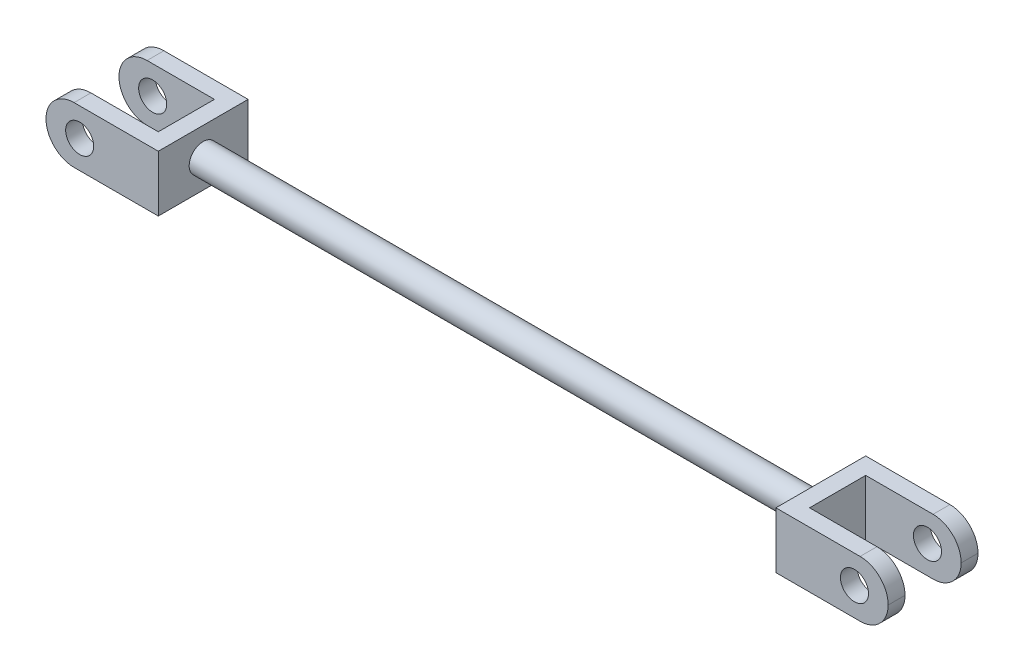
ISO-10303-21;
HEADER;
FILE_DESCRIPTION(('STEP AP214'),'2;1');
FILE_NAME('part.step','',(''),(''),'','','');
FILE_SCHEMA(('AUTOMOTIVE_DESIGN { 1 0 10303 214 1 1 1 1 }'));
ENDSEC;
DATA;
#1=APPLICATION_CONTEXT('core data for automotive mechanical design processes');
#2=APPLICATION_PROTOCOL_DEFINITION('international standard','automotive_design',2000,#1);
#3=PRODUCT_CONTEXT('',#1,'mechanical');
#4=PRODUCT('Part','Part','',(#3));
#5=PRODUCT_RELATED_PRODUCT_CATEGORY('part','',(#4));
#6=PRODUCT_DEFINITION_FORMATION('','',#4);
#7=PRODUCT_DEFINITION_CONTEXT('part definition',#1,'design');
#8=PRODUCT_DEFINITION('design','',#6,#7);
#9=PRODUCT_DEFINITION_SHAPE('','',#8);
#10=(LENGTH_UNIT() NAMED_UNIT(*) SI_UNIT(.MILLI.,.METRE.));
#11=(NAMED_UNIT(*) PLANE_ANGLE_UNIT() SI_UNIT($,.RADIAN.));
#12=(NAMED_UNIT(*) SI_UNIT($,.STERADIAN.) SOLID_ANGLE_UNIT());
#13=UNCERTAINTY_MEASURE_WITH_UNIT(LENGTH_MEASURE(1.E-05),#10,'distance_accuracy_value','');
#14=(GEOMETRIC_REPRESENTATION_CONTEXT(3) GLOBAL_UNCERTAINTY_ASSIGNED_CONTEXT((#13)) GLOBAL_UNIT_ASSIGNED_CONTEXT((#10,
#11,#12)) REPRESENTATION_CONTEXT('',''));
#15=CARTESIAN_POINT('',(0.,0.,0.));
#16=DIRECTION('',(0.,0.,1.));
#17=DIRECTION('',(1.,0.,0.));
#18=AXIS2_PLACEMENT_3D('',#15,#16,#17);
#19=CARTESIAN_POINT('',(0.,4.99999999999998,5.));
#20=DIRECTION('',(0.,0.,-0.999999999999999));
#21=DIRECTION('',(-1.,0.,0.));
#22=AXIS2_PLACEMENT_3D('',#19,#20,#21);
#23=PLANE('',#22);
#24=CARTESIAN_POINT('',(6.00000000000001,0.,5.));
#25=DIRECTION('',(0.,0.,-0.999999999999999));
#26=DIRECTION('',(-1.,0.,0.));
#27=AXIS2_PLACEMENT_3D('',#24,#25,#26);
#28=CIRCLE('',#27,2.5);
#29=CARTESIAN_POINT('',(8.50000000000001,0.,5.));
#30=VERTEX_POINT('',#29);
#31=EDGE_CURVE('E294',#30,#30,#28,.T.);
#32=ORIENTED_EDGE('',*,*,#31,.F.);
#33=EDGE_LOOP('',(#32));
#34=FACE_BOUND('',#33,.T.);
#35=DIRECTION('',(1.,0.,0.));
#36=VECTOR('',#35,1.);
#37=CARTESIAN_POINT('',(0.,-5.,5.));
#38=LINE('',#37,#36);
#39=CARTESIAN_POINT('',(5.,-5.,5.));
#40=VERTEX_POINT('',#39);
#41=CARTESIAN_POINT('',(17.,-5.,5.));
#42=VERTEX_POINT('',#41);
#43=EDGE_CURVE('E297',#40,#42,#38,.T.);
#44=ORIENTED_EDGE('',*,*,#43,.F.);
#45=CARTESIAN_POINT('',(5.,0.,5.));
#46=DIRECTION('',(0.,0.,-0.999999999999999));
#47=DIRECTION('',(-1.,0.,0.));
#48=AXIS2_PLACEMENT_3D('',#45,#46,#47);
#49=CIRCLE('',#48,5.);
#50=CARTESIAN_POINT('',(0.,0.,5.));
#51=VERTEX_POINT('',#50);
#52=EDGE_CURVE('E71',#40,#51,#49,.T.);
#53=ORIENTED_EDGE('',*,*,#52,.T.);
#54=CARTESIAN_POINT('',(5.,0.,5.));
#55=DIRECTION('',(0.,0.,-0.999999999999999));
#56=DIRECTION('',(-1.,0.,0.));
#57=AXIS2_PLACEMENT_3D('',#54,#55,#56);
#58=CIRCLE('',#57,5.);
#59=CARTESIAN_POINT('',(5.,5.,5.));
#60=VERTEX_POINT('',#59);
#61=EDGE_CURVE('E357',#51,#60,#58,.T.);
#62=ORIENTED_EDGE('',*,*,#61,.T.);
#63=DIRECTION('',(1.,0.,0.));
#64=VECTOR('',#63,1.);
#65=CARTESIAN_POINT('',(0.,4.99999999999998,5.));
#66=LINE('',#65,#64);
#67=CARTESIAN_POINT('',(17.,5.,5.));
#68=VERTEX_POINT('',#67);
#69=EDGE_CURVE('E298',#60,#68,#66,.T.);
#70=ORIENTED_EDGE('',*,*,#69,.T.);
#71=DIRECTION('',(0.,-1.,0.));
#72=VECTOR('',#71,1.);
#73=CARTESIAN_POINT('',(17.,5.,5.));
#74=LINE('',#73,#72);
#75=EDGE_CURVE('E313',#68,#42,#74,.T.);
#76=ORIENTED_EDGE('',*,*,#75,.T.);
#77=EDGE_LOOP('',(#44,#53,#62,#70,#76));
#78=FACE_BOUND('',#77,.T.);
#79=ADVANCED_FACE('F48',(#34,#78),#23,.T.);
#80=CARTESIAN_POINT('',(0.,4.99999999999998,7.99999999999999));
#81=DIRECTION('',(0.,0.,0.999999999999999));
#82=DIRECTION('',(1.,0.,0.));
#83=AXIS2_PLACEMENT_3D('',#80,#81,#82);
#84=PLANE('',#83);
#85=CARTESIAN_POINT('',(6.00000000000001,0.,7.99999999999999));
#86=DIRECTION('',(0.,0.,0.999999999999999));
#87=DIRECTION('',(1.,0.,0.));
#88=AXIS2_PLACEMENT_3D('',#85,#86,#87);
#89=CIRCLE('',#88,2.5);
#90=CARTESIAN_POINT('',(8.50000000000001,0.,7.99999999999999));
#91=VERTEX_POINT('',#90);
#92=EDGE_CURVE('E291',#91,#91,#89,.T.);
#93=ORIENTED_EDGE('',*,*,#92,.F.);
#94=EDGE_LOOP('',(#93));
#95=FACE_BOUND('',#94,.T.);
#96=CARTESIAN_POINT('',(5.,0.,7.99999999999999));
#97=DIRECTION('',(0.,0.,0.999999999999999));
#98=DIRECTION('',(1.,0.,0.));
#99=AXIS2_PLACEMENT_3D('',#96,#97,#98);
#100=CIRCLE('',#99,5.);
#101=CARTESIAN_POINT('',(5.,5.,7.99999999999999));
#102=VERTEX_POINT('',#101);
#103=CARTESIAN_POINT('',(0.,0.,7.99999999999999));
#104=VERTEX_POINT('',#103);
#105=EDGE_CURVE('E63',#102,#104,#100,.T.);
#106=ORIENTED_EDGE('',*,*,#105,.T.);
#107=CARTESIAN_POINT('',(5.,0.,7.99999999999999));
#108=DIRECTION('',(0.,0.,0.999999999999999));
#109=DIRECTION('',(1.,0.,0.));
#110=AXIS2_PLACEMENT_3D('',#107,#108,#109);
#111=CIRCLE('',#110,5.);
#112=CARTESIAN_POINT('',(5.,-5.,7.99999999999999));
#113=VERTEX_POINT('',#112);
#114=EDGE_CURVE('E56',#104,#113,#111,.T.);
#115=ORIENTED_EDGE('',*,*,#114,.T.);
#116=DIRECTION('',(-1.,0.,0.));
#117=VECTOR('',#116,1.);
#118=CARTESIAN_POINT('',(0.,-5.,7.99999999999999));
#119=LINE('',#118,#117);
#120=CARTESIAN_POINT('',(20.,-5.,7.99999999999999));
#121=VERTEX_POINT('',#120);
#122=EDGE_CURVE('E315',#121,#113,#119,.T.);
#123=ORIENTED_EDGE('',*,*,#122,.F.);
#124=DIRECTION('',(0.,-1.,0.));
#125=VECTOR('',#124,1.);
#126=CARTESIAN_POINT('',(20.,4.99999999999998,7.99999999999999));
#127=LINE('',#126,#125);
#128=CARTESIAN_POINT('',(20.,4.99999999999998,7.99999999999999));
#129=VERTEX_POINT('',#128);
#130=EDGE_CURVE('E335',#129,#121,#127,.T.);
#131=ORIENTED_EDGE('',*,*,#130,.F.);
#132=DIRECTION('',(-1.,0.,0.));
#133=VECTOR('',#132,1.);
#134=CARTESIAN_POINT('',(0.,4.99999999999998,7.99999999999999));
#135=LINE('',#134,#133);
#136=EDGE_CURVE('E300',#129,#102,#135,.T.);
#137=ORIENTED_EDGE('',*,*,#136,.T.);
#138=EDGE_LOOP('',(#106,#115,#123,#131,#137));
#139=FACE_BOUND('',#138,.T.);
#140=ADVANCED_FACE('F387',(#95,#139),#84,.T.);
#141=CARTESIAN_POINT('',(20.,4.99999999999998,0.));
#142=DIRECTION('',(-1.,0.,0.));
#143=DIRECTION('',(0.,0.,0.999999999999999));
#144=AXIS2_PLACEMENT_3D('',#141,#142,#143);
#145=PLANE('',#144);
#146=CARTESIAN_POINT('',(20.,0.,0.));
#147=DIRECTION('',(-1.,0.,0.));
#148=DIRECTION('',(0.,0.,0.999999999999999));
#149=AXIS2_PLACEMENT_3D('',#146,#147,#148);
#150=CIRCLE('',#149,2.5);
#151=CARTESIAN_POINT('',(20.,0.,2.5));
#152=VERTEX_POINT('',#151);
#153=EDGE_CURVE('E13',#152,#152,#150,.F.);
#154=ORIENTED_EDGE('',*,*,#153,.F.);
#155=EDGE_LOOP('',(#154));
#156=FACE_BOUND('',#155,.T.);
#157=DIRECTION('',(0.,0.,-0.999999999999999));
#158=VECTOR('',#157,1.);
#159=CARTESIAN_POINT('',(20.,-5.,0.));
#160=LINE('',#159,#158);
#161=CARTESIAN_POINT('',(20.,-5.,-7.99999999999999));
#162=VERTEX_POINT('',#161);
#163=EDGE_CURVE('E318',#121,#162,#160,.T.);
#164=ORIENTED_EDGE('',*,*,#163,.T.);
#165=DIRECTION('',(0.,-1.,0.));
#166=VECTOR('',#165,1.);
#167=CARTESIAN_POINT('',(20.,4.99999999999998,-7.99999999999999));
#168=LINE('',#167,#166);
#169=CARTESIAN_POINT('',(20.,4.99999999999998,-7.99999999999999));
#170=VERTEX_POINT('',#169);
#171=EDGE_CURVE('E332',#170,#162,#168,.T.);
#172=ORIENTED_EDGE('',*,*,#171,.F.);
#173=DIRECTION('',(0.,0.,-0.999999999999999));
#174=VECTOR('',#173,1.);
#175=CARTESIAN_POINT('',(20.,4.99999999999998,0.));
#176=LINE('',#175,#174);
#177=EDGE_CURVE('E303',#129,#170,#176,.T.);
#178=ORIENTED_EDGE('',*,*,#177,.F.);
#179=ORIENTED_EDGE('',*,*,#130,.T.);
#180=EDGE_LOOP('',(#164,#172,#178,#179));
#181=FACE_BOUND('',#180,.T.);
#182=ADVANCED_FACE('F391',(#156,#181),#145,.F.);
#183=CARTESIAN_POINT('',(0.,4.99999999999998,-7.99999999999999));
#184=DIRECTION('',(0.,0.,0.999999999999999));
#185=DIRECTION('',(1.,0.,0.));
#186=AXIS2_PLACEMENT_3D('',#183,#184,#185);
#187=PLANE('',#186);
#188=CARTESIAN_POINT('',(6.00000000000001,0.,-7.99999999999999));
#189=DIRECTION('',(0.,0.,0.999999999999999));
#190=DIRECTION('',(1.,0.,0.));
#191=AXIS2_PLACEMENT_3D('',#188,#189,#190);
#192=CIRCLE('',#191,2.5);
#193=CARTESIAN_POINT('',(8.50000000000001,0.,-7.99999999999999));
#194=VERTEX_POINT('',#193);
#195=EDGE_CURVE('E286',#194,#194,#192,.T.);
#196=ORIENTED_EDGE('',*,*,#195,.T.);
#197=EDGE_LOOP('',(#196));
#198=FACE_BOUND('',#197,.T.);
#199=CARTESIAN_POINT('',(5.,0.,-7.99999999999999));
#200=DIRECTION('',(0.,0.,0.999999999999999));
#201=DIRECTION('',(1.,0.,0.));
#202=AXIS2_PLACEMENT_3D('',#199,#200,#201);
#203=CIRCLE('',#202,5.);
#204=CARTESIAN_POINT('',(5.,-5.,-7.99999999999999));
#205=VERTEX_POINT('',#204);
#206=CARTESIAN_POINT('',(0.,0.,-7.99999999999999));
#207=VERTEX_POINT('',#206);
#208=EDGE_CURVE('E348',#205,#207,#203,.F.);
#209=ORIENTED_EDGE('',*,*,#208,.T.);
#210=CARTESIAN_POINT('',(5.,0.,-7.99999999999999));
#211=DIRECTION('',(0.,0.,0.999999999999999));
#212=DIRECTION('',(1.,0.,0.));
#213=AXIS2_PLACEMENT_3D('',#210,#211,#212);
#214=CIRCLE('',#213,5.);
#215=CARTESIAN_POINT('',(5.,5.,-7.99999999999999));
#216=VERTEX_POINT('',#215);
#217=EDGE_CURVE('E350',#207,#216,#214,.F.);
#218=ORIENTED_EDGE('',*,*,#217,.T.);
#219=DIRECTION('',(-1.,0.,0.));
#220=VECTOR('',#219,1.);
#221=CARTESIAN_POINT('',(0.,4.99999999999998,-7.99999999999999));
#222=LINE('',#221,#220);
#223=EDGE_CURVE('E305',#170,#216,#222,.T.);
#224=ORIENTED_EDGE('',*,*,#223,.F.);
#225=ORIENTED_EDGE('',*,*,#171,.T.);
#226=DIRECTION('',(-1.,0.,0.));
#227=VECTOR('',#226,1.);
#228=CARTESIAN_POINT('',(0.,-5.,-7.99999999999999));
#229=LINE('',#228,#227);
#230=EDGE_CURVE('E320',#162,#205,#229,.T.);
#231=ORIENTED_EDGE('',*,*,#230,.T.);
#232=EDGE_LOOP('',(#209,#218,#224,#225,#231));
#233=FACE_BOUND('',#232,.T.);
#234=ADVANCED_FACE('F406',(#198,#233),#187,.F.);
#235=CARTESIAN_POINT('',(0.,4.99999999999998,-5.));
#236=DIRECTION('',(0.,0.,-0.999999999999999));
#237=DIRECTION('',(-1.,0.,0.));
#238=AXIS2_PLACEMENT_3D('',#235,#236,#237);
#239=PLANE('',#238);
#240=CARTESIAN_POINT('',(6.00000000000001,0.,-5.));
#241=DIRECTION('',(0.,0.,-0.999999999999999));
#242=DIRECTION('',(-1.,0.,0.));
#243=AXIS2_PLACEMENT_3D('',#240,#241,#242);
#244=CIRCLE('',#243,2.5);
#245=CARTESIAN_POINT('',(8.50000000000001,0.,-4.99999999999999));
#246=VERTEX_POINT('',#245);
#247=EDGE_CURVE('E289',#246,#246,#244,.T.);
#248=ORIENTED_EDGE('',*,*,#247,.T.);
#249=EDGE_LOOP('',(#248));
#250=FACE_BOUND('',#249,.T.);
#251=DIRECTION('',(1.,0.,0.));
#252=VECTOR('',#251,1.);
#253=CARTESIAN_POINT('',(0.,4.99999999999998,-5.));
#254=LINE('',#253,#252);
#255=CARTESIAN_POINT('',(5.,5.,-5.));
#256=VERTEX_POINT('',#255);
#257=CARTESIAN_POINT('',(17.,5.,-5.));
#258=VERTEX_POINT('',#257);
#259=EDGE_CURVE('E308',#256,#258,#254,.T.);
#260=ORIENTED_EDGE('',*,*,#259,.F.);
#261=CARTESIAN_POINT('',(5.,0.,-5.));
#262=DIRECTION('',(0.,0.,-0.999999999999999));
#263=DIRECTION('',(-1.,0.,0.));
#264=AXIS2_PLACEMENT_3D('',#261,#262,#263);
#265=CIRCLE('',#264,5.);
#266=CARTESIAN_POINT('',(0.,0.,-5.));
#267=VERTEX_POINT('',#266);
#268=EDGE_CURVE('E346',#256,#267,#265,.F.);
#269=ORIENTED_EDGE('',*,*,#268,.T.);
#270=CARTESIAN_POINT('',(5.,0.,-5.));
#271=DIRECTION('',(0.,0.,-0.999999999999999));
#272=DIRECTION('',(-1.,0.,0.));
#273=AXIS2_PLACEMENT_3D('',#270,#271,#272);
#274=CIRCLE('',#273,5.);
#275=CARTESIAN_POINT('',(5.,-5.,-5.));
#276=VERTEX_POINT('',#275);
#277=EDGE_CURVE('E344',#267,#276,#274,.F.);
#278=ORIENTED_EDGE('',*,*,#277,.T.);
#279=DIRECTION('',(1.,0.,0.));
#280=VECTOR('',#279,1.);
#281=CARTESIAN_POINT('',(0.,-5.,-5.));
#282=LINE('',#281,#280);
#283=CARTESIAN_POINT('',(17.,-5.,-5.));
#284=VERTEX_POINT('',#283);
#285=EDGE_CURVE('E323',#276,#284,#282,.T.);
#286=ORIENTED_EDGE('',*,*,#285,.T.);
#287=DIRECTION('',(0.,-1.,0.));
#288=VECTOR('',#287,1.);
#289=CARTESIAN_POINT('',(17.,5.,-5.));
#290=LINE('',#289,#288);
#291=EDGE_CURVE('E329',#258,#284,#290,.T.);
#292=ORIENTED_EDGE('',*,*,#291,.F.);
#293=EDGE_LOOP('',(#260,#269,#278,#286,#292));
#294=FACE_BOUND('',#293,.T.);
#295=ADVANCED_FACE('F401',(#250,#294),#239,.F.);
#296=CARTESIAN_POINT('',(17.,5.,0.));
#297=DIRECTION('',(1.,0.,0.));
#298=DIRECTION('',(0.,0.,-0.999999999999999));
#299=AXIS2_PLACEMENT_3D('',#296,#297,#298);
#300=PLANE('',#299);
#301=DIRECTION('',(0.,0.,0.999999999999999));
#302=VECTOR('',#301,1.);
#303=CARTESIAN_POINT('',(17.,-5.,0.));
#304=LINE('',#303,#302);
#305=EDGE_CURVE('E301',#284,#42,#304,.T.);
#306=ORIENTED_EDGE('',*,*,#305,.T.);
#307=ORIENTED_EDGE('',*,*,#75,.F.);
#308=DIRECTION('',(0.,0.,0.999999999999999));
#309=VECTOR('',#308,1.);
#310=CARTESIAN_POINT('',(17.,5.,0.));
#311=LINE('',#310,#309);
#312=EDGE_CURVE('E310',#258,#68,#311,.T.);
#313=ORIENTED_EDGE('',*,*,#312,.F.);
#314=ORIENTED_EDGE('',*,*,#291,.T.);
#315=EDGE_LOOP('',(#306,#307,#313,#314));
#316=FACE_BOUND('',#315,.T.);
#317=ADVANCED_FACE('F379',(#316),#300,.F.);
#318=CARTESIAN_POINT('',(0.,4.99999999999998,0.));
#319=DIRECTION('',(0.,1.,0.));
#320=DIRECTION('',(0.,0.,0.999999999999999));
#321=AXIS2_PLACEMENT_3D('',#318,#319,#320);
#322=PLANE('',#321);
#323=ORIENTED_EDGE('',*,*,#223,.T.);
#324=DIRECTION('',(0.,0.,0.999999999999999));
#325=VECTOR('',#324,1.);
#326=CARTESIAN_POINT('',(5.,5.,-5.));
#327=LINE('',#326,#325);
#328=EDGE_CURVE('E341',#216,#256,#327,.T.);
#329=ORIENTED_EDGE('',*,*,#328,.T.);
#330=ORIENTED_EDGE('',*,*,#259,.T.);
#331=ORIENTED_EDGE('',*,*,#312,.T.);
#332=ORIENTED_EDGE('',*,*,#69,.F.);
#333=DIRECTION('',(0.,0.,-0.999999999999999));
#334=VECTOR('',#333,1.);
#335=CARTESIAN_POINT('',(5.,5.,0.));
#336=LINE('',#335,#334);
#337=EDGE_CURVE('E337',#60,#102,#336,.F.);
#338=ORIENTED_EDGE('',*,*,#337,.T.);
#339=ORIENTED_EDGE('',*,*,#136,.F.);
#340=ORIENTED_EDGE('',*,*,#177,.T.);
#341=EDGE_LOOP('',(#323,#329,#330,#331,#332,#338,#339,#340));
#342=FACE_BOUND('',#341,.T.);
#343=ADVANCED_FACE('F372',(#342),#322,.T.);
#344=CARTESIAN_POINT('',(0.,-5.,0.));
#345=DIRECTION('',(0.,1.,0.));
#346=DIRECTION('',(0.,0.,0.999999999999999));
#347=AXIS2_PLACEMENT_3D('',#344,#345,#346);
#348=PLANE('',#347);
#349=ORIENTED_EDGE('',*,*,#285,.F.);
#350=DIRECTION('',(0.,0.,0.999999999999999));
#351=VECTOR('',#350,1.);
#352=CARTESIAN_POINT('',(5.,-5.,0.));
#353=LINE('',#352,#351);
#354=EDGE_CURVE('E355',#276,#205,#353,.F.);
#355=ORIENTED_EDGE('',*,*,#354,.T.);
#356=ORIENTED_EDGE('',*,*,#230,.F.);
#357=ORIENTED_EDGE('',*,*,#163,.F.);
#358=ORIENTED_EDGE('',*,*,#122,.T.);
#359=DIRECTION('',(0.,0.,-0.999999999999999));
#360=VECTOR('',#359,1.);
#361=CARTESIAN_POINT('',(5.,-5.,5.));
#362=LINE('',#361,#360);
#363=EDGE_CURVE('E352',#113,#40,#362,.T.);
#364=ORIENTED_EDGE('',*,*,#363,.T.);
#365=ORIENTED_EDGE('',*,*,#43,.T.);
#366=ORIENTED_EDGE('',*,*,#305,.F.);
#367=EDGE_LOOP('',(#349,#355,#356,#357,#358,#364,#365,#366));
#368=FACE_BOUND('',#367,.T.);
#369=ADVANCED_FACE('F383',(#368),#348,.F.);
#370=CARTESIAN_POINT('',(6.00000000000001,0.,-7.99999999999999));
#371=DIRECTION('',(0.,0.,0.999999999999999));
#372=DIRECTION('',(1.,0.,0.));
#373=AXIS2_PLACEMENT_3D('',#370,#371,#372);
#374=CYLINDRICAL_SURFACE('',#373,2.5);
#375=CARTESIAN_POINT('',(8.50000000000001,0.,-7.99999999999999));
#376=CARTESIAN_POINT('',(8.50000000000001,0.,-7.96874999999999));
#377=CARTESIAN_POINT('',(8.50000000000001,0.,-7.93749999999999));
#378=CARTESIAN_POINT('',(8.50000000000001,0.,-7.87499999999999));
#379=CARTESIAN_POINT('',(8.50000000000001,0.,-7.84374999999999));
#380=CARTESIAN_POINT('',(8.50000000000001,0.,-7.78124999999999));
#381=CARTESIAN_POINT('',(8.50000000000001,0.,-7.74999999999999));
#382=CARTESIAN_POINT('',(8.50000000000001,0.,-7.68749999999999));
#383=CARTESIAN_POINT('',(8.50000000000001,0.,-7.65624999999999));
#384=CARTESIAN_POINT('',(8.50000000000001,0.,-7.59374999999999));
#385=CARTESIAN_POINT('',(8.50000000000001,0.,-7.56249999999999));
#386=CARTESIAN_POINT('',(8.50000000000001,0.,-7.49999999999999));
#387=CARTESIAN_POINT('',(8.50000000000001,0.,-7.46874999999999));
#388=CARTESIAN_POINT('',(8.50000000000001,0.,-7.40624999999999));
#389=CARTESIAN_POINT('',(8.50000000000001,0.,-7.37499999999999));
#390=CARTESIAN_POINT('',(8.50000000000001,0.,-7.31249999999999));
#391=CARTESIAN_POINT('',(8.50000000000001,0.,-7.28124999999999));
#392=CARTESIAN_POINT('',(8.50000000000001,0.,-7.21874999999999));
#393=CARTESIAN_POINT('',(8.50000000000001,0.,-7.18749999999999));
#394=CARTESIAN_POINT('',(8.50000000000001,0.,-7.12499999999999));
#395=CARTESIAN_POINT('',(8.50000000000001,0.,-7.09374999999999));
#396=CARTESIAN_POINT('',(8.50000000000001,0.,-7.03124999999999));
#397=CARTESIAN_POINT('',(8.50000000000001,0.,-6.99999999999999));
#398=CARTESIAN_POINT('',(8.50000000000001,0.,-6.93749999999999));
#399=CARTESIAN_POINT('',(8.50000000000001,0.,-6.90624999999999));
#400=CARTESIAN_POINT('',(8.50000000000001,0.,-6.84374999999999));
#401=CARTESIAN_POINT('',(8.50000000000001,0.,-6.81249999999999));
#402=CARTESIAN_POINT('',(8.50000000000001,0.,-6.74999999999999));
#403=CARTESIAN_POINT('',(8.50000000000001,0.,-6.71874999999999));
#404=CARTESIAN_POINT('',(8.50000000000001,0.,-6.65624999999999));
#405=CARTESIAN_POINT('',(8.50000000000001,0.,-6.62499999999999));
#406=CARTESIAN_POINT('',(8.50000000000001,0.,-6.56249999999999));
#407=CARTESIAN_POINT('',(8.50000000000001,0.,-6.53124999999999));
#408=CARTESIAN_POINT('',(8.50000000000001,0.,-6.46874999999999));
#409=CARTESIAN_POINT('',(8.50000000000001,0.,-6.43749999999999));
#410=CARTESIAN_POINT('',(8.50000000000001,0.,-6.37499999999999));
#411=CARTESIAN_POINT('',(8.50000000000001,0.,-6.34374999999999));
#412=CARTESIAN_POINT('',(8.50000000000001,0.,-6.28124999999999));
#413=CARTESIAN_POINT('',(8.50000000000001,0.,-6.24999999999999));
#414=CARTESIAN_POINT('',(8.50000000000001,0.,-6.18749999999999));
#415=CARTESIAN_POINT('',(8.50000000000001,0.,-6.15624999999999));
#416=CARTESIAN_POINT('',(8.50000000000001,0.,-6.09374999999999));
#417=CARTESIAN_POINT('',(8.50000000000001,0.,-6.06249999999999));
#418=CARTESIAN_POINT('',(8.50000000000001,0.,-5.99999999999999));
#419=CARTESIAN_POINT('',(8.50000000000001,0.,-5.96874999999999));
#420=CARTESIAN_POINT('',(8.50000000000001,0.,-5.90624999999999));
#421=CARTESIAN_POINT('',(8.50000000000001,0.,-5.87499999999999));
#422=CARTESIAN_POINT('',(8.50000000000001,0.,-5.81249999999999));
#423=CARTESIAN_POINT('',(8.50000000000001,0.,-5.78124999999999));
#424=CARTESIAN_POINT('',(8.50000000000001,0.,-5.71874999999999));
#425=CARTESIAN_POINT('',(8.50000000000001,0.,-5.68749999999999));
#426=CARTESIAN_POINT('',(8.50000000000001,0.,-5.62499999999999));
#427=CARTESIAN_POINT('',(8.50000000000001,0.,-5.59374999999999));
#428=CARTESIAN_POINT('',(8.50000000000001,0.,-5.53124999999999));
#429=CARTESIAN_POINT('',(8.50000000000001,0.,-5.49999999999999));
#430=CARTESIAN_POINT('',(8.50000000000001,0.,-5.43749999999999));
#431=CARTESIAN_POINT('',(8.50000000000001,0.,-5.40624999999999));
#432=CARTESIAN_POINT('',(8.50000000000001,0.,-5.34374999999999));
#433=CARTESIAN_POINT('',(8.50000000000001,0.,-5.3125));
#434=CARTESIAN_POINT('',(8.50000000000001,0.,-5.25));
#435=CARTESIAN_POINT('',(8.50000000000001,0.,-5.21874999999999));
#436=CARTESIAN_POINT('',(8.50000000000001,0.,-5.15624999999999));
#437=CARTESIAN_POINT('',(8.50000000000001,0.,-5.12499999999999));
#438=CARTESIAN_POINT('',(8.50000000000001,0.,-5.06249999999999));
#439=CARTESIAN_POINT('',(8.50000000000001,0.,-5.03124999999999));
#440=CARTESIAN_POINT('',(8.50000000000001,0.,-4.99999999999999));
#441=B_SPLINE_CURVE_WITH_KNOTS('',3,(#375,#376,#377,#378,#379,#380,#381,#382,#383,#384,#385,
#386,#387,#388,#389,#390,#391,#392,#393,#394,#395,#396,#397,#398,#399,#400,#401,#402,#403,#404,
#405,#406,#407,#408,#409,#410,#411,#412,#413,#414,#415,#416,#417,#418,#419,#420,#421,#422,#423,
#424,#425,#426,#427,#428,#429,#430,#431,#432,#433,#434,#435,#436,#437,#438,#439,#440),
.UNSPECIFIED.,.F.,.F.,(4,2,2,2,2,2,2,2,2,2,2,2,2,2,2,2,2,2,2,2,2,2,2,2,2,2,2,2,2,2,2,2,4),(0.,
0.0937500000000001,0.187500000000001,0.281250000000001,0.375,0.46875,0.5625,0.656250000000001,
0.750000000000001,0.843750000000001,0.937500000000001,1.03125,1.125,1.21875,1.3125,1.40625,1.5,
1.59375,1.6875,1.78125,1.875,1.96875,2.0625,2.15625,2.25,2.34375,2.4375,2.53125,2.625,2.71875,
2.8125,2.90625,3.),.UNSPECIFIED.);
#442=EDGE_CURVE('BSEAM457',#194,#246,#441,.T.);
#443=ORIENTED_EDGE('',*,*,#195,.F.);
#444=ORIENTED_EDGE('',*,*,#247,.F.);
#445=ORIENTED_EDGE('',*,*,#442,.T.);
#446=ORIENTED_EDGE('',*,*,#442,.F.);
#447=EDGE_LOOP('',(#443,#445,#444,#446));
#448=FACE_BOUND('',#447,.T.);
#449=ADVANCED_FACE('F457',(#448),#374,.F.);
#450=CARTESIAN_POINT('',(8.50000000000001,0.,5.));
#451=CARTESIAN_POINT('',(8.50000000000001,0.,5.03125));
#452=CARTESIAN_POINT('',(8.50000000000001,0.,5.0625));
#453=CARTESIAN_POINT('',(8.50000000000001,0.,5.125));
#454=CARTESIAN_POINT('',(8.50000000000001,0.,5.15625));
#455=CARTESIAN_POINT('',(8.50000000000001,0.,5.21875));
#456=CARTESIAN_POINT('',(8.50000000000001,0.,5.25));
#457=CARTESIAN_POINT('',(8.50000000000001,0.,5.3125));
#458=CARTESIAN_POINT('',(8.50000000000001,0.,5.34375));
#459=CARTESIAN_POINT('',(8.50000000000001,0.,5.40625));
#460=CARTESIAN_POINT('',(8.50000000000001,0.,5.4375));
#461=CARTESIAN_POINT('',(8.50000000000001,0.,5.5));
#462=CARTESIAN_POINT('',(8.50000000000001,0.,5.53125));
#463=CARTESIAN_POINT('',(8.50000000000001,0.,5.59375));
#464=CARTESIAN_POINT('',(8.50000000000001,0.,5.625));
#465=CARTESIAN_POINT('',(8.50000000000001,0.,5.6875));
#466=CARTESIAN_POINT('',(8.50000000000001,0.,5.71875));
#467=CARTESIAN_POINT('',(8.50000000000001,0.,5.78125));
#468=CARTESIAN_POINT('',(8.50000000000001,0.,5.8125));
#469=CARTESIAN_POINT('',(8.50000000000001,0.,5.87499999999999));
#470=CARTESIAN_POINT('',(8.50000000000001,0.,5.90624999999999));
#471=CARTESIAN_POINT('',(8.50000000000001,0.,5.96874999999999));
#472=CARTESIAN_POINT('',(8.50000000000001,0.,5.99999999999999));
#473=CARTESIAN_POINT('',(8.50000000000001,0.,6.06249999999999));
#474=CARTESIAN_POINT('',(8.50000000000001,0.,6.09374999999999));
#475=CARTESIAN_POINT('',(8.50000000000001,0.,6.15624999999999));
#476=CARTESIAN_POINT('',(8.50000000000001,0.,6.18749999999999));
#477=CARTESIAN_POINT('',(8.50000000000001,0.,6.25));
#478=CARTESIAN_POINT('',(8.50000000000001,0.,6.28125));
#479=CARTESIAN_POINT('',(8.50000000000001,0.,6.34375));
#480=CARTESIAN_POINT('',(8.50000000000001,0.,6.375));
#481=CARTESIAN_POINT('',(8.50000000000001,0.,6.4375));
#482=CARTESIAN_POINT('',(8.50000000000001,0.,6.46875));
#483=CARTESIAN_POINT('',(8.50000000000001,0.,6.53125));
#484=CARTESIAN_POINT('',(8.50000000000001,0.,6.5625));
#485=CARTESIAN_POINT('',(8.50000000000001,0.,6.62499999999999));
#486=CARTESIAN_POINT('',(8.50000000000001,0.,6.65624999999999));
#487=CARTESIAN_POINT('',(8.50000000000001,0.,6.71874999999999));
#488=CARTESIAN_POINT('',(8.50000000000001,0.,6.74999999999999));
#489=CARTESIAN_POINT('',(8.50000000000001,0.,6.81249999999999));
#490=CARTESIAN_POINT('',(8.50000000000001,0.,6.84374999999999));
#491=CARTESIAN_POINT('',(8.50000000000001,0.,6.90624999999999));
#492=CARTESIAN_POINT('',(8.50000000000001,0.,6.93749999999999));
#493=CARTESIAN_POINT('',(8.50000000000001,0.,6.99999999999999));
#494=CARTESIAN_POINT('',(8.50000000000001,0.,7.03124999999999));
#495=CARTESIAN_POINT('',(8.50000000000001,0.,7.09374999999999));
#496=CARTESIAN_POINT('',(8.50000000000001,0.,7.12499999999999));
#497=CARTESIAN_POINT('',(8.50000000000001,0.,7.18749999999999));
#498=CARTESIAN_POINT('',(8.50000000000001,0.,7.21874999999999));
#499=CARTESIAN_POINT('',(8.50000000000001,0.,7.28124999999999));
#500=CARTESIAN_POINT('',(8.50000000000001,0.,7.31249999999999));
#501=CARTESIAN_POINT('',(8.50000000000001,0.,7.37499999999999));
#502=CARTESIAN_POINT('',(8.50000000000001,0.,7.40624999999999));
#503=CARTESIAN_POINT('',(8.50000000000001,0.,7.46874999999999));
#504=CARTESIAN_POINT('',(8.50000000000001,0.,7.49999999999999));
#505=CARTESIAN_POINT('',(8.50000000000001,0.,7.56249999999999));
#506=CARTESIAN_POINT('',(8.50000000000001,0.,7.59374999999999));
#507=CARTESIAN_POINT('',(8.50000000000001,0.,7.65624999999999));
#508=CARTESIAN_POINT('',(8.50000000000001,0.,7.68749999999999));
#509=CARTESIAN_POINT('',(8.50000000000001,0.,7.74999999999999));
#510=CARTESIAN_POINT('',(8.50000000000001,0.,7.78124999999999));
#511=CARTESIAN_POINT('',(8.50000000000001,0.,7.84374999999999));
#512=CARTESIAN_POINT('',(8.50000000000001,0.,7.87499999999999));
#513=CARTESIAN_POINT('',(8.50000000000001,0.,7.93749999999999));
#514=CARTESIAN_POINT('',(8.50000000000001,0.,7.96874999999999));
#515=CARTESIAN_POINT('',(8.50000000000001,0.,7.99999999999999));
#516=B_SPLINE_CURVE_WITH_KNOTS('',3,(#450,#451,#452,#453,#454,#455,#456,#457,#458,#459,#460,
#461,#462,#463,#464,#465,#466,#467,#468,#469,#470,#471,#472,#473,#474,#475,#476,#477,#478,#479,
#480,#481,#482,#483,#484,#485,#486,#487,#488,#489,#490,#491,#492,#493,#494,#495,#496,#497,#498,
#499,#500,#501,#502,#503,#504,#505,#506,#507,#508,#509,#510,#511,#512,#513,#514,#515),
.UNSPECIFIED.,.F.,.F.,(4,2,2,2,2,2,2,2,2,2,2,2,2,2,2,2,2,2,2,2,2,2,2,2,2,2,2,2,2,2,2,2,4),(0.,
0.0937500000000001,0.1875,0.28125,0.375,0.46875,0.5625,0.656250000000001,0.750000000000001,
0.843749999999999,0.937499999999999,1.03125,1.125,1.21875,1.3125,1.40625,1.5,1.59375,1.6875,
1.78125,1.875,1.96875,2.0625,2.15625,2.25,2.34375,2.4375,2.53125,2.625,2.71875,2.8125,2.90625,
3.),.UNSPECIFIED.);
#517=EDGE_CURVE('BSEAM431',#30,#91,#516,.T.);
#518=ORIENTED_EDGE('',*,*,#31,.T.);
#519=ORIENTED_EDGE('',*,*,#92,.T.);
#520=ORIENTED_EDGE('',*,*,#517,.T.);
#521=ORIENTED_EDGE('',*,*,#517,.F.);
#522=EDGE_LOOP('',(#518,#520,#519,#521));
#523=FACE_BOUND('',#522,.T.);
#524=ADVANCED_FACE('F431',(#523),#374,.F.);
#525=CARTESIAN_POINT('',(5.,0.,0.));
#526=DIRECTION('',(0.,0.,0.999999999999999));
#527=DIRECTION('',(1.,0.,0.));
#528=AXIS2_PLACEMENT_3D('',#525,#526,#527);
#529=CYLINDRICAL_SURFACE('',#528,5.);
#530=DIRECTION('',(0.,0.,0.999999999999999));
#531=VECTOR('',#530,1.);
#532=CARTESIAN_POINT('',(0.,0.,0.));
#533=LINE('',#532,#531);
#534=EDGE_CURVE('E290',#207,#267,#533,.T.);
#535=ORIENTED_EDGE('',*,*,#534,.F.);
#536=ORIENTED_EDGE('',*,*,#208,.F.);
#537=ORIENTED_EDGE('',*,*,#354,.F.);
#538=ORIENTED_EDGE('',*,*,#277,.F.);
#539=EDGE_LOOP('',(#535,#536,#537,#538));
#540=FACE_BOUND('',#539,.T.);
#541=ADVANCED_FACE('F404',(#540),#529,.T.);
#542=CARTESIAN_POINT('',(5.,0.,0.));
#543=DIRECTION('',(0.,0.,-0.999999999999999));
#544=DIRECTION('',(-1.,0.,0.));
#545=AXIS2_PLACEMENT_3D('',#542,#543,#544);
#546=CYLINDRICAL_SURFACE('',#545,5.);
#547=ORIENTED_EDGE('',*,*,#217,.F.);
#548=ORIENTED_EDGE('',*,*,#534,.T.);
#549=ORIENTED_EDGE('',*,*,#268,.F.);
#550=ORIENTED_EDGE('',*,*,#328,.F.);
#551=EDGE_LOOP('',(#547,#548,#549,#550));
#552=FACE_BOUND('',#551,.T.);
#553=ADVANCED_FACE('F397',(#552),#546,.T.);
#554=CARTESIAN_POINT('',(5.,0.,0.));
#555=DIRECTION('',(0.,0.,-0.999999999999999));
#556=DIRECTION('',(-1.,0.,0.));
#557=AXIS2_PLACEMENT_3D('',#554,#555,#556);
#558=CYLINDRICAL_SURFACE('',#557,5.);
#559=DIRECTION('',(0.,0.,-0.999999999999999));
#560=VECTOR('',#559,1.);
#561=CARTESIAN_POINT('',(0.,0.,0.));
#562=LINE('',#561,#560);
#563=EDGE_CURVE('E285',#104,#51,#562,.T.);
#564=ORIENTED_EDGE('',*,*,#563,.F.);
#565=ORIENTED_EDGE('',*,*,#105,.F.);
#566=ORIENTED_EDGE('',*,*,#337,.F.);
#567=ORIENTED_EDGE('',*,*,#61,.F.);
#568=EDGE_LOOP('',(#564,#565,#566,#567));
#569=FACE_BOUND('',#568,.T.);
#570=ADVANCED_FACE('F50',(#569),#558,.T.);
#571=CARTESIAN_POINT('',(5.,0.,0.));
#572=DIRECTION('',(0.,0.,0.999999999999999));
#573=DIRECTION('',(1.,0.,0.));
#574=AXIS2_PLACEMENT_3D('',#571,#572,#573);
#575=CYLINDRICAL_SURFACE('',#574,5.);
#576=ORIENTED_EDGE('',*,*,#114,.F.);
#577=ORIENTED_EDGE('',*,*,#563,.T.);
#578=ORIENTED_EDGE('',*,*,#52,.F.);
#579=ORIENTED_EDGE('',*,*,#363,.F.);
#580=EDGE_LOOP('',(#576,#577,#578,#579));
#581=FACE_BOUND('',#580,.T.);
#582=ADVANCED_FACE('F366',(#581),#575,.T.);
#583=CARTESIAN_POINT('',(130.,0.,0.));
#584=DIRECTION('',(-1.,0.,0.));
#585=DIRECTION('',(0.,0.,0.999999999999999));
#586=AXIS2_PLACEMENT_3D('',#583,#584,#585);
#587=CYLINDRICAL_SURFACE('',#586,2.5);
#588=CARTESIAN_POINT('',(130.,0.,0.));
#589=DIRECTION('',(1.,0.,0.));
#590=DIRECTION('',(0.,0.,-0.999999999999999));
#591=AXIS2_PLACEMENT_3D('',#588,#589,#590);
#592=CIRCLE('',#591,2.5);
#593=CARTESIAN_POINT('',(130.,0.,-2.5));
#594=VERTEX_POINT('',#593);
#595=EDGE_CURVE('E282',#594,#594,#592,.T.);
#596=ORIENTED_EDGE('',*,*,#595,.F.);
#597=EDGE_LOOP('',(#596));
#598=FACE_BOUND('',#597,.T.);
#599=ORIENTED_EDGE('',*,*,#153,.T.);
#600=EDGE_LOOP('',(#599));
#601=FACE_BOUND('',#600,.T.);
#602=ADVANCED_FACE('F433',(#598,#601),#587,.T.);
#603=CARTESIAN_POINT('',(150.,5.,5.));
#604=DIRECTION('',(0.,0.,-0.999999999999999));
#605=DIRECTION('',(1.,0.,0.));
#606=AXIS2_PLACEMENT_3D('',#603,#604,#605);
#607=PLANE('',#606);
#608=CARTESIAN_POINT('',(144.,0.,5.));
#609=DIRECTION('',(0.,0.,0.999999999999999));
#610=DIRECTION('',(1.,0.,0.));
#611=AXIS2_PLACEMENT_3D('',#608,#609,#610);
#612=CIRCLE('',#611,2.5);
#613=CARTESIAN_POINT('',(141.5,0.,5.));
#614=VERTEX_POINT('',#613);
#615=EDGE_CURVE('E584',#614,#614,#612,.T.);
#616=ORIENTED_EDGE('',*,*,#615,.T.);
#617=EDGE_LOOP('',(#616));
#618=FACE_BOUND('',#617,.T.);
#619=DIRECTION('',(-1.,0.,0.));
#620=VECTOR('',#619,1.);
#621=CARTESIAN_POINT('',(150.,-5.,5.));
#622=LINE('',#621,#620);
#623=CARTESIAN_POINT('',(145.,-5.,5.));
#624=VERTEX_POINT('',#623);
#625=CARTESIAN_POINT('',(133.,-5.,5.));
#626=VERTEX_POINT('',#625);
#627=EDGE_CURVE('E262',#624,#626,#622,.T.);
#628=ORIENTED_EDGE('',*,*,#627,.T.);
#629=DIRECTION('',(0.,-1.,0.));
#630=VECTOR('',#629,1.);
#631=CARTESIAN_POINT('',(133.,4.99999999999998,5.));
#632=LINE('',#631,#630);
#633=CARTESIAN_POINT('',(133.,4.99999999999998,5.));
#634=VERTEX_POINT('',#633);
#635=EDGE_CURVE('E267',#634,#626,#632,.T.);
#636=ORIENTED_EDGE('',*,*,#635,.F.);
#637=DIRECTION('',(-1.,0.,0.));
#638=VECTOR('',#637,1.);
#639=CARTESIAN_POINT('',(150.,5.,5.));
#640=LINE('',#639,#638);
#641=CARTESIAN_POINT('',(145.,4.99999999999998,5.));
#642=VERTEX_POINT('',#641);
#643=EDGE_CURVE('E231',#642,#634,#640,.T.);
#644=ORIENTED_EDGE('',*,*,#643,.F.);
#645=CARTESIAN_POINT('',(145.,0.,5.));
#646=DIRECTION('',(0.,0.,0.999999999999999));
#647=DIRECTION('',(1.,0.,0.));
#648=AXIS2_PLACEMENT_3D('',#645,#646,#647);
#649=CIRCLE('',#648,5.);
#650=CARTESIAN_POINT('',(150.,0.,5.));
#651=VERTEX_POINT('',#650);
#652=EDGE_CURVE('E219',#651,#642,#649,.T.);
#653=ORIENTED_EDGE('',*,*,#652,.F.);
#654=CARTESIAN_POINT('',(145.,0.,5.));
#655=DIRECTION('',(0.,0.,0.999999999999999));
#656=DIRECTION('',(1.,0.,0.));
#657=AXIS2_PLACEMENT_3D('',#654,#655,#656);
#658=CIRCLE('',#657,5.);
#659=EDGE_CURVE('E207',#624,#651,#658,.T.);
#660=ORIENTED_EDGE('',*,*,#659,.F.);
#661=EDGE_LOOP('',(#628,#636,#644,#653,#660));
#662=FACE_BOUND('',#661,.T.);
#663=ADVANCED_FACE('F438',(#618,#662),#607,.T.);
#664=CARTESIAN_POINT('',(130.,5.,0.));
#665=DIRECTION('',(1.,0.,0.));
#666=DIRECTION('',(0.,0.,0.999999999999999));
#667=AXIS2_PLACEMENT_3D('',#664,#665,#666);
#668=PLANE('',#667);
#669=ORIENTED_EDGE('',*,*,#595,.T.);
#670=EDGE_LOOP('',(#669));
#671=FACE_BOUND('',#670,.T.);
#672=DIRECTION('',(0.,0.,-0.999999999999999));
#673=VECTOR('',#672,1.);
#674=CARTESIAN_POINT('',(130.,-5.,0.));
#675=LINE('',#674,#673);
#676=CARTESIAN_POINT('',(130.,-5.,7.99999999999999));
#677=VERTEX_POINT('',#676);
#678=CARTESIAN_POINT('',(130.,-5.,-7.99999999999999));
#679=VERTEX_POINT('',#678);
#680=EDGE_CURVE('E259',#677,#679,#675,.T.);
#681=ORIENTED_EDGE('',*,*,#680,.F.);
#682=DIRECTION('',(0.,-1.,0.));
#683=VECTOR('',#682,1.);
#684=CARTESIAN_POINT('',(130.,5.,7.99999999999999));
#685=LINE('',#684,#683);
#686=CARTESIAN_POINT('',(130.,5.,7.99999999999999));
#687=VERTEX_POINT('',#686);
#688=EDGE_CURVE('E213',#687,#677,#685,.T.);
#689=ORIENTED_EDGE('',*,*,#688,.F.);
#690=DIRECTION('',(0.,0.,-0.999999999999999));
#691=VECTOR('',#690,1.);
#692=CARTESIAN_POINT('',(130.,5.,0.));
#693=LINE('',#692,#691);
#694=CARTESIAN_POINT('',(130.,5.,-7.99999999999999));
#695=VERTEX_POINT('',#694);
#696=EDGE_CURVE('E234',#687,#695,#693,.T.);
#697=ORIENTED_EDGE('',*,*,#696,.T.);
#698=DIRECTION('',(0.,-1.,0.));
#699=VECTOR('',#698,1.);
#700=CARTESIAN_POINT('',(130.,5.,-7.99999999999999));
#701=LINE('',#700,#699);
#702=EDGE_CURVE('E279',#695,#679,#701,.T.);
#703=ORIENTED_EDGE('',*,*,#702,.T.);
#704=EDGE_LOOP('',(#681,#689,#697,#703));
#705=FACE_BOUND('',#704,.T.);
#706=ADVANCED_FACE('F508',(#671,#705),#668,.F.);
#707=CARTESIAN_POINT('',(150.,5.,-7.99999999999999));
#708=DIRECTION('',(0.,0.,0.999999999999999));
#709=DIRECTION('',(-1.,0.,0.));
#710=AXIS2_PLACEMENT_3D('',#707,#708,#709);
#711=PLANE('',#710);
#712=CARTESIAN_POINT('',(144.,0.,-7.99999999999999));
#713=DIRECTION('',(0.,0.,-0.999999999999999));
#714=DIRECTION('',(-1.,0.,0.));
#715=AXIS2_PLACEMENT_3D('',#712,#713,#714);
#716=CIRCLE('',#715,2.5);
#717=CARTESIAN_POINT('',(141.5,0.,-7.99999999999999));
#718=VERTEX_POINT('',#717);
#719=EDGE_CURVE('E276',#718,#718,#716,.T.);
#720=ORIENTED_EDGE('',*,*,#719,.F.);
#721=EDGE_LOOP('',(#720));
#722=FACE_BOUND('',#721,.T.);
#723=CARTESIAN_POINT('',(145.,0.,-7.99999999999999));
#724=DIRECTION('',(0.,0.,-0.999999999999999));
#725=DIRECTION('',(-1.,0.,0.));
#726=AXIS2_PLACEMENT_3D('',#723,#724,#725);
#727=CIRCLE('',#726,5.);
#728=CARTESIAN_POINT('',(145.,-5.,-7.99999999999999));
#729=VERTEX_POINT('',#728);
#730=CARTESIAN_POINT('',(150.,0.,-7.99999999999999));
#731=VERTEX_POINT('',#730);
#732=EDGE_CURVE('E245',#729,#731,#727,.F.);
#733=ORIENTED_EDGE('',*,*,#732,.F.);
#734=DIRECTION('',(1.,0.,0.));
#735=VECTOR('',#734,1.);
#736=CARTESIAN_POINT('',(150.,-5.,-7.99999999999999));
#737=LINE('',#736,#735);
#738=EDGE_CURVE('E256',#679,#729,#737,.T.);
#739=ORIENTED_EDGE('',*,*,#738,.F.);
#740=ORIENTED_EDGE('',*,*,#702,.F.);
#741=DIRECTION('',(1.,0.,0.));
#742=VECTOR('',#741,1.);
#743=CARTESIAN_POINT('',(150.,5.,-7.99999999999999));
#744=LINE('',#743,#742);
#745=CARTESIAN_POINT('',(145.,4.99999999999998,-7.99999999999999));
#746=VERTEX_POINT('',#745);
#747=EDGE_CURVE('E221',#695,#746,#744,.T.);
#748=ORIENTED_EDGE('',*,*,#747,.T.);
#749=CARTESIAN_POINT('',(145.,0.,-7.99999999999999));
#750=DIRECTION('',(0.,0.,-0.999999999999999));
#751=DIRECTION('',(-1.,0.,0.));
#752=AXIS2_PLACEMENT_3D('',#749,#750,#751);
#753=CIRCLE('',#752,5.);
#754=EDGE_CURVE('E237',#731,#746,#753,.F.);
#755=ORIENTED_EDGE('',*,*,#754,.F.);
#756=EDGE_LOOP('',(#733,#739,#740,#748,#755));
#757=FACE_BOUND('',#756,.T.);
#758=ADVANCED_FACE('F512',(#722,#757),#711,.F.);
#759=CARTESIAN_POINT('',(144.,0.,-7.99999999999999));
#760=DIRECTION('',(0.,0.,0.999999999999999));
#761=DIRECTION('',(-1.,0.,0.));
#762=AXIS2_PLACEMENT_3D('',#759,#760,#761);
#763=CYLINDRICAL_SURFACE('',#762,2.5);
#764=CARTESIAN_POINT('',(144.,0.,-5.));
#765=DIRECTION('',(0.,0.,0.999999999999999));
#766=DIRECTION('',(1.,0.,0.));
#767=AXIS2_PLACEMENT_3D('',#764,#765,#766);
#768=CIRCLE('',#767,2.5);
#769=CARTESIAN_POINT('',(141.5,0.,-5.));
#770=VERTEX_POINT('',#769);
#771=EDGE_CURVE('E273',#770,#770,#768,.T.);
#772=CARTESIAN_POINT('',(141.5,0.,-7.99999999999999));
#773=CARTESIAN_POINT('',(141.5,0.,-7.96874999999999));
#774=CARTESIAN_POINT('',(141.5,0.,-7.93749999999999));
#775=CARTESIAN_POINT('',(141.5,0.,-7.87499999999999));
#776=CARTESIAN_POINT('',(141.5,0.,-7.84374999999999));
#777=CARTESIAN_POINT('',(141.5,0.,-7.78124999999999));
#778=CARTESIAN_POINT('',(141.5,0.,-7.74999999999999));
#779=CARTESIAN_POINT('',(141.5,0.,-7.68749999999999));
#780=CARTESIAN_POINT('',(141.5,0.,-7.65624999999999));
#781=CARTESIAN_POINT('',(141.5,0.,-7.59374999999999));
#782=CARTESIAN_POINT('',(141.5,0.,-7.56249999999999));
#783=CARTESIAN_POINT('',(141.5,0.,-7.49999999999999));
#784=CARTESIAN_POINT('',(141.5,0.,-7.46874999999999));
#785=CARTESIAN_POINT('',(141.5,0.,-7.40624999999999));
#786=CARTESIAN_POINT('',(141.5,0.,-7.37499999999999));
#787=CARTESIAN_POINT('',(141.5,0.,-7.31249999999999));
#788=CARTESIAN_POINT('',(141.5,0.,-7.28124999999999));
#789=CARTESIAN_POINT('',(141.5,0.,-7.21874999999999));
#790=CARTESIAN_POINT('',(141.5,0.,-7.18749999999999));
#791=CARTESIAN_POINT('',(141.5,0.,-7.12499999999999));
#792=CARTESIAN_POINT('',(141.5,0.,-7.09374999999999));
#793=CARTESIAN_POINT('',(141.5,0.,-7.03124999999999));
#794=CARTESIAN_POINT('',(141.5,0.,-6.99999999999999));
#795=CARTESIAN_POINT('',(141.5,0.,-6.93749999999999));
#796=CARTESIAN_POINT('',(141.5,0.,-6.90624999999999));
#797=CARTESIAN_POINT('',(141.5,0.,-6.84374999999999));
#798=CARTESIAN_POINT('',(141.5,0.,-6.81249999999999));
#799=CARTESIAN_POINT('',(141.5,0.,-6.74999999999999));
#800=CARTESIAN_POINT('',(141.5,0.,-6.71874999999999));
#801=CARTESIAN_POINT('',(141.5,0.,-6.65624999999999));
#802=CARTESIAN_POINT('',(141.5,0.,-6.62499999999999));
#803=CARTESIAN_POINT('',(141.5,0.,-6.56249999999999));
#804=CARTESIAN_POINT('',(141.5,0.,-6.53124999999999));
#805=CARTESIAN_POINT('',(141.5,0.,-6.46874999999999));
#806=CARTESIAN_POINT('',(141.5,0.,-6.4375));
#807=CARTESIAN_POINT('',(141.5,0.,-6.375));
#808=CARTESIAN_POINT('',(141.5,0.,-6.34375));
#809=CARTESIAN_POINT('',(141.5,0.,-6.28125));
#810=CARTESIAN_POINT('',(141.5,0.,-6.25));
#811=CARTESIAN_POINT('',(141.5,0.,-6.18749999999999));
#812=CARTESIAN_POINT('',(141.5,0.,-6.15624999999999));
#813=CARTESIAN_POINT('',(141.5,0.,-6.09374999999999));
#814=CARTESIAN_POINT('',(141.5,0.,-6.06249999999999));
#815=CARTESIAN_POINT('',(141.5,0.,-5.99999999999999));
#816=CARTESIAN_POINT('',(141.5,0.,-5.96874999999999));
#817=CARTESIAN_POINT('',(141.5,0.,-5.90624999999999));
#818=CARTESIAN_POINT('',(141.5,0.,-5.87499999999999));
#819=CARTESIAN_POINT('',(141.5,0.,-5.8125));
#820=CARTESIAN_POINT('',(141.5,0.,-5.78125));
#821=CARTESIAN_POINT('',(141.5,0.,-5.71875));
#822=CARTESIAN_POINT('',(141.5,0.,-5.6875));
#823=CARTESIAN_POINT('',(141.5,0.,-5.625));
#824=CARTESIAN_POINT('',(141.5,0.,-5.59375));
#825=CARTESIAN_POINT('',(141.5,0.,-5.53125));
#826=CARTESIAN_POINT('',(141.5,0.,-5.5));
#827=CARTESIAN_POINT('',(141.5,0.,-5.4375));
#828=CARTESIAN_POINT('',(141.5,0.,-5.40625));
#829=CARTESIAN_POINT('',(141.5,0.,-5.34375));
#830=CARTESIAN_POINT('',(141.5,0.,-5.3125));
#831=CARTESIAN_POINT('',(141.5,0.,-5.25));
#832=CARTESIAN_POINT('',(141.5,0.,-5.21875));
#833=CARTESIAN_POINT('',(141.5,0.,-5.15625));
#834=CARTESIAN_POINT('',(141.5,0.,-5.125));
#835=CARTESIAN_POINT('',(141.5,0.,-5.0625));
#836=CARTESIAN_POINT('',(141.5,0.,-5.03125));
#837=CARTESIAN_POINT('',(141.5,0.,-5.));
#838=B_SPLINE_CURVE_WITH_KNOTS('',3,(#772,#773,#774,#775,#776,#777,#778,#779,#780,#781,#782,
#783,#784,#785,#786,#787,#788,#789,#790,#791,#792,#793,#794,#795,#796,#797,#798,#799,#800,#801,
#802,#803,#804,#805,#806,#807,#808,#809,#810,#811,#812,#813,#814,#815,#816,#817,#818,#819,#820,
#821,#822,#823,#824,#825,#826,#827,#828,#829,#830,#831,#832,#833,#834,#835,#836,#837),
.UNSPECIFIED.,.F.,.F.,(4,2,2,2,2,2,2,2,2,2,2,2,2,2,2,2,2,2,2,2,2,2,2,2,2,2,2,2,2,2,2,2,4),(0.,
0.0937500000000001,0.1875,0.28125,0.375,0.46875,0.5625,0.65625,0.75,0.84375,0.937499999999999,
1.03125,1.125,1.21875,1.3125,1.40625,1.5,1.59375,1.6875,1.78125,1.875,1.96875,2.0625,2.15625,
2.25,2.34375,2.4375,2.53125,2.625,2.71875,2.8125,2.90625,3.),.UNSPECIFIED.);
#839=EDGE_CURVE('BSEAM516',#718,#770,#838,.T.);
#840=ORIENTED_EDGE('',*,*,#719,.T.);
#841=ORIENTED_EDGE('',*,*,#771,.T.);
#842=ORIENTED_EDGE('',*,*,#839,.T.);
#843=ORIENTED_EDGE('',*,*,#839,.F.);
#844=EDGE_LOOP('',(#840,#842,#841,#843));
#845=FACE_BOUND('',#844,.T.);
#846=ADVANCED_FACE('F516',(#845),#763,.F.);
#847=CARTESIAN_POINT('',(150.,5.,-5.));
#848=DIRECTION('',(0.,0.,-0.999999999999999));
#849=DIRECTION('',(1.,0.,0.));
#850=AXIS2_PLACEMENT_3D('',#847,#848,#849);
#851=PLANE('',#850);
#852=ORIENTED_EDGE('',*,*,#771,.F.);
#853=EDGE_LOOP('',(#852));
#854=FACE_BOUND('',#853,.T.);
#855=DIRECTION('',(-1.,0.,0.));
#856=VECTOR('',#855,1.);
#857=CARTESIAN_POINT('',(150.,5.,-5.));
#858=LINE('',#857,#856);
#859=CARTESIAN_POINT('',(145.,4.99999999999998,-5.));
#860=VERTEX_POINT('',#859);
#861=CARTESIAN_POINT('',(133.,4.99999999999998,-5.));
#862=VERTEX_POINT('',#861);
#863=EDGE_CURVE('E226',#860,#862,#858,.T.);
#864=ORIENTED_EDGE('',*,*,#863,.T.);
#865=DIRECTION('',(0.,-1.,0.));
#866=VECTOR('',#865,1.);
#867=CARTESIAN_POINT('',(133.,4.99999999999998,-5.));
#868=LINE('',#867,#866);
#869=CARTESIAN_POINT('',(133.,-5.,-5.));
#870=VERTEX_POINT('',#869);
#871=EDGE_CURVE('E270',#862,#870,#868,.T.);
#872=ORIENTED_EDGE('',*,*,#871,.T.);
#873=DIRECTION('',(-1.,0.,0.));
#874=VECTOR('',#873,1.);
#875=CARTESIAN_POINT('',(150.,-5.,-5.));
#876=LINE('',#875,#874);
#877=CARTESIAN_POINT('',(145.,-5.,-5.));
#878=VERTEX_POINT('',#877);
#879=EDGE_CURVE('E253',#878,#870,#876,.T.);
#880=ORIENTED_EDGE('',*,*,#879,.F.);
#881=CARTESIAN_POINT('',(145.,0.,-5.));
#882=DIRECTION('',(0.,0.,0.999999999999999));
#883=DIRECTION('',(1.,0.,0.));
#884=AXIS2_PLACEMENT_3D('',#881,#882,#883);
#885=CIRCLE('',#884,5.);
#886=CARTESIAN_POINT('',(150.,0.,-5.));
#887=VERTEX_POINT('',#886);
#888=EDGE_CURVE('E250',#887,#878,#885,.F.);
#889=ORIENTED_EDGE('',*,*,#888,.F.);
#890=CARTESIAN_POINT('',(145.,0.,-5.));
#891=DIRECTION('',(0.,0.,0.999999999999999));
#892=DIRECTION('',(1.,0.,0.));
#893=AXIS2_PLACEMENT_3D('',#890,#891,#892);
#894=CIRCLE('',#893,5.);
#895=EDGE_CURVE('E242',#860,#887,#894,.F.);
#896=ORIENTED_EDGE('',*,*,#895,.F.);
#897=EDGE_LOOP('',(#864,#872,#880,#889,#896));
#898=FACE_BOUND('',#897,.T.);
#899=ADVANCED_FACE('F518',(#854,#898),#851,.F.);
#900=CARTESIAN_POINT('',(133.,4.99999999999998,0.));
#901=DIRECTION('',(-1.,0.,0.));
#902=DIRECTION('',(0.,0.,-0.999999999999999));
#903=AXIS2_PLACEMENT_3D('',#900,#901,#902);
#904=PLANE('',#903);
#905=DIRECTION('',(0.,0.,0.999999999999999));
#906=VECTOR('',#905,1.);
#907=CARTESIAN_POINT('',(133.,-5.,0.));
#908=LINE('',#907,#906);
#909=EDGE_CURVE('E265',#870,#626,#908,.T.);
#910=ORIENTED_EDGE('',*,*,#909,.F.);
#911=ORIENTED_EDGE('',*,*,#871,.F.);
#912=DIRECTION('',(0.,0.,0.999999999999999));
#913=VECTOR('',#912,1.);
#914=CARTESIAN_POINT('',(133.,4.99999999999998,0.));
#915=LINE('',#914,#913);
#916=EDGE_CURVE('E229',#862,#634,#915,.T.);
#917=ORIENTED_EDGE('',*,*,#916,.T.);
#918=ORIENTED_EDGE('',*,*,#635,.T.);
#919=EDGE_LOOP('',(#910,#911,#917,#918));
#920=FACE_BOUND('',#919,.T.);
#921=ADVANCED_FACE('F521',(#920),#904,.F.);
#922=CARTESIAN_POINT('',(150.,-5.,0.));
#923=DIRECTION('',(0.,1.,0.));
#924=DIRECTION('',(0.,0.,0.999999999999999));
#925=AXIS2_PLACEMENT_3D('',#922,#923,#924);
#926=PLANE('',#925);
#927=ORIENTED_EDGE('',*,*,#879,.T.);
#928=ORIENTED_EDGE('',*,*,#909,.T.);
#929=ORIENTED_EDGE('',*,*,#627,.F.);
#930=DIRECTION('',(0.,0.,-0.999999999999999));
#931=VECTOR('',#930,1.);
#932=CARTESIAN_POINT('',(145.,-5.,5.));
#933=LINE('',#932,#931);
#934=CARTESIAN_POINT('',(145.,-5.,7.99999999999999));
#935=VERTEX_POINT('',#934);
#936=EDGE_CURVE('E211',#935,#624,#933,.T.);
#937=ORIENTED_EDGE('',*,*,#936,.F.);
#938=DIRECTION('',(1.,0.,0.));
#939=VECTOR('',#938,1.);
#940=CARTESIAN_POINT('',(150.,-5.,7.99999999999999));
#941=LINE('',#940,#939);
#942=EDGE_CURVE('E191',#677,#935,#941,.T.);
#943=ORIENTED_EDGE('',*,*,#942,.F.);
#944=ORIENTED_EDGE('',*,*,#680,.T.);
#945=ORIENTED_EDGE('',*,*,#738,.T.);
#946=DIRECTION('',(0.,0.,0.999999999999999));
#947=VECTOR('',#946,1.);
#948=CARTESIAN_POINT('',(145.,-5.,0.));
#949=LINE('',#948,#947);
#950=EDGE_CURVE('E248',#878,#729,#949,.F.);
#951=ORIENTED_EDGE('',*,*,#950,.F.);
#952=EDGE_LOOP('',(#927,#928,#929,#937,#943,#944,#945,#951));
#953=FACE_BOUND('',#952,.T.);
#954=ADVANCED_FACE('F525',(#953),#926,.F.);
#955=CARTESIAN_POINT('',(145.,0.,0.));
#956=DIRECTION('',(0.,0.,0.999999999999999));
#957=DIRECTION('',(-1.,0.,0.));
#958=AXIS2_PLACEMENT_3D('',#955,#956,#957);
#959=CYLINDRICAL_SURFACE('',#958,5.);
#960=DIRECTION('',(0.,0.,0.999999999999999));
#961=VECTOR('',#960,1.);
#962=CARTESIAN_POINT('',(150.,0.,0.));
#963=LINE('',#962,#961);
#964=EDGE_CURVE('E240',#731,#887,#963,.T.);
#965=ORIENTED_EDGE('',*,*,#964,.T.);
#966=ORIENTED_EDGE('',*,*,#888,.T.);
#967=ORIENTED_EDGE('',*,*,#950,.T.);
#968=ORIENTED_EDGE('',*,*,#732,.T.);
#969=EDGE_LOOP('',(#965,#966,#967,#968));
#970=FACE_BOUND('',#969,.T.);
#971=ADVANCED_FACE('F529',(#970),#959,.T.);
#972=CARTESIAN_POINT('',(145.,0.,0.));
#973=DIRECTION('',(0.,0.,-0.999999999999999));
#974=DIRECTION('',(1.,0.,0.));
#975=AXIS2_PLACEMENT_3D('',#972,#973,#974);
#976=CYLINDRICAL_SURFACE('',#975,5.);
#977=ORIENTED_EDGE('',*,*,#754,.T.);
#978=DIRECTION('',(0.,0.,0.999999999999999));
#979=VECTOR('',#978,1.);
#980=CARTESIAN_POINT('',(145.,4.99999999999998,-5.));
#981=LINE('',#980,#979);
#982=EDGE_CURVE('E224',#746,#860,#981,.T.);
#983=ORIENTED_EDGE('',*,*,#982,.T.);
#984=ORIENTED_EDGE('',*,*,#895,.T.);
#985=ORIENTED_EDGE('',*,*,#964,.F.);
#986=EDGE_LOOP('',(#977,#983,#984,#985));
#987=FACE_BOUND('',#986,.T.);
#988=ADVANCED_FACE('F533',(#987),#976,.T.);
#989=CARTESIAN_POINT('',(150.,5.,0.));
#990=DIRECTION('',(0.,1.,0.));
#991=DIRECTION('',(0.,0.,0.999999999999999));
#992=AXIS2_PLACEMENT_3D('',#989,#990,#991);
#993=PLANE('',#992);
#994=ORIENTED_EDGE('',*,*,#747,.F.);
#995=ORIENTED_EDGE('',*,*,#696,.F.);
#996=DIRECTION('',(1.,0.,0.));
#997=VECTOR('',#996,1.);
#998=CARTESIAN_POINT('',(150.,5.,7.99999999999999));
#999=LINE('',#998,#997);
#1000=CARTESIAN_POINT('',(145.,4.99999999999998,7.99999999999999));
#1001=VERTEX_POINT('',#1000);
#1002=EDGE_CURVE('E209',#687,#1001,#999,.T.);
#1003=ORIENTED_EDGE('',*,*,#1002,.T.);
#1004=DIRECTION('',(0.,0.,-0.999999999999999));
#1005=VECTOR('',#1004,1.);
#1006=CARTESIAN_POINT('',(145.,4.99999999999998,0.));
#1007=LINE('',#1006,#1005);
#1008=EDGE_CURVE('E201',#642,#1001,#1007,.F.);
#1009=ORIENTED_EDGE('',*,*,#1008,.F.);
#1010=ORIENTED_EDGE('',*,*,#643,.T.);
#1011=ORIENTED_EDGE('',*,*,#916,.F.);
#1012=ORIENTED_EDGE('',*,*,#863,.F.);
#1013=ORIENTED_EDGE('',*,*,#982,.F.);
#1014=EDGE_LOOP('',(#994,#995,#1003,#1009,#1010,#1011,#1012,#1013));
#1015=FACE_BOUND('',#1014,.T.);
#1016=ADVANCED_FACE('F537',(#1015),#993,.T.);
#1017=CARTESIAN_POINT('',(145.,0.,0.));
#1018=DIRECTION('',(0.,0.,-0.999999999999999));
#1019=DIRECTION('',(1.,0.,0.));
#1020=AXIS2_PLACEMENT_3D('',#1017,#1018,#1019);
#1021=CYLINDRICAL_SURFACE('',#1020,5.);
#1022=DIRECTION('',(0.,0.,-0.999999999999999));
#1023=VECTOR('',#1022,1.);
#1024=CARTESIAN_POINT('',(150.,0.,0.));
#1025=LINE('',#1024,#1023);
#1026=CARTESIAN_POINT('',(150.,0.,7.99999999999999));
#1027=VERTEX_POINT('',#1026);
#1028=EDGE_CURVE('E199',#1027,#651,#1025,.T.);
#1029=ORIENTED_EDGE('',*,*,#1028,.T.);
#1030=ORIENTED_EDGE('',*,*,#652,.T.);
#1031=ORIENTED_EDGE('',*,*,#1008,.T.);
#1032=CARTESIAN_POINT('',(145.,0.,7.99999999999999));
#1033=DIRECTION('',(0.,0.,-0.999999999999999));
#1034=DIRECTION('',(-1.,0.,0.));
#1035=AXIS2_PLACEMENT_3D('',#1032,#1033,#1034);
#1036=CIRCLE('',#1035,5.);
#1037=EDGE_CURVE('E188',#1001,#1027,#1036,.T.);
#1038=ORIENTED_EDGE('',*,*,#1037,.T.);
#1039=EDGE_LOOP('',(#1029,#1030,#1031,#1038));
#1040=FACE_BOUND('',#1039,.T.);
#1041=ADVANCED_FACE('F197',(#1040),#1021,.T.);
#1042=CARTESIAN_POINT('',(145.,0.,0.));
#1043=DIRECTION('',(0.,0.,0.999999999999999));
#1044=DIRECTION('',(-1.,0.,0.));
#1045=AXIS2_PLACEMENT_3D('',#1042,#1043,#1044);
#1046=CYLINDRICAL_SURFACE('',#1045,5.);
#1047=CARTESIAN_POINT('',(145.,0.,7.99999999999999));
#1048=DIRECTION('',(0.,0.,-0.999999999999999));
#1049=DIRECTION('',(-1.,0.,0.));
#1050=AXIS2_PLACEMENT_3D('',#1047,#1048,#1049);
#1051=CIRCLE('',#1050,5.);
#1052=EDGE_CURVE('E185',#1027,#935,#1051,.T.);
#1053=ORIENTED_EDGE('',*,*,#1052,.T.);
#1054=ORIENTED_EDGE('',*,*,#936,.T.);
#1055=ORIENTED_EDGE('',*,*,#659,.T.);
#1056=ORIENTED_EDGE('',*,*,#1028,.F.);
#1057=EDGE_LOOP('',(#1053,#1054,#1055,#1056));
#1058=FACE_BOUND('',#1057,.T.);
#1059=ADVANCED_FACE('F205',(#1058),#1046,.T.);
#1060=CARTESIAN_POINT('',(150.,5.,7.99999999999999));
#1061=DIRECTION('',(0.,0.,0.999999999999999));
#1062=DIRECTION('',(-1.,0.,0.));
#1063=AXIS2_PLACEMENT_3D('',#1060,#1061,#1062);
#1064=PLANE('',#1063);
#1065=CARTESIAN_POINT('',(144.,0.,7.99999999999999));
#1066=DIRECTION('',(0.,0.,-0.999999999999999));
#1067=DIRECTION('',(-1.,0.,0.));
#1068=AXIS2_PLACEMENT_3D('',#1065,#1066,#1067);
#1069=CIRCLE('',#1068,2.5);
#1070=CARTESIAN_POINT('',(141.5,0.,7.99999999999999));
#1071=VERTEX_POINT('',#1070);
#1072=EDGE_CURVE('E203',#1071,#1071,#1069,.T.);
#1073=ORIENTED_EDGE('',*,*,#1072,.T.);
#1074=EDGE_LOOP('',(#1073));
#1075=FACE_BOUND('',#1074,.T.);
#1076=ORIENTED_EDGE('',*,*,#1037,.F.);
#1077=ORIENTED_EDGE('',*,*,#1002,.F.);
#1078=ORIENTED_EDGE('',*,*,#688,.T.);
#1079=ORIENTED_EDGE('',*,*,#942,.T.);
#1080=ORIENTED_EDGE('',*,*,#1052,.F.);
#1081=EDGE_LOOP('',(#1076,#1077,#1078,#1079,#1080));
#1082=FACE_BOUND('',#1081,.T.);
#1083=ADVANCED_FACE('F187',(#1075,#1082),#1064,.T.);
#1084=CARTESIAN_POINT('',(141.5,0.,5.));
#1085=CARTESIAN_POINT('',(141.5,0.,5.03125));
#1086=CARTESIAN_POINT('',(141.5,0.,5.0625));
#1087=CARTESIAN_POINT('',(141.5,0.,5.125));
#1088=CARTESIAN_POINT('',(141.5,0.,5.15625));
#1089=CARTESIAN_POINT('',(141.5,0.,5.21875));
#1090=CARTESIAN_POINT('',(141.5,0.,5.25));
#1091=CARTESIAN_POINT('',(141.5,0.,5.3125));
#1092=CARTESIAN_POINT('',(141.5,0.,5.34375));
#1093=CARTESIAN_POINT('',(141.5,0.,5.40625));
#1094=CARTESIAN_POINT('',(141.5,0.,5.4375));
#1095=CARTESIAN_POINT('',(141.5,0.,5.5));
#1096=CARTESIAN_POINT('',(141.5,0.,5.53125));
#1097=CARTESIAN_POINT('',(141.5,0.,5.59375));
#1098=CARTESIAN_POINT('',(141.5,0.,5.625));
#1099=CARTESIAN_POINT('',(141.5,0.,5.6875));
#1100=CARTESIAN_POINT('',(141.5,0.,5.71875));
#1101=CARTESIAN_POINT('',(141.5,0.,5.78125));
#1102=CARTESIAN_POINT('',(141.5,0.,5.8125));
#1103=CARTESIAN_POINT('',(141.5,0.,5.87499999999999));
#1104=CARTESIAN_POINT('',(141.5,0.,5.90624999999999));
#1105=CARTESIAN_POINT('',(141.5,0.,5.96874999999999));
#1106=CARTESIAN_POINT('',(141.5,0.,5.99999999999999));
#1107=CARTESIAN_POINT('',(141.5,0.,6.06249999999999));
#1108=CARTESIAN_POINT('',(141.5,0.,6.09374999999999));
#1109=CARTESIAN_POINT('',(141.5,0.,6.15624999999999));
#1110=CARTESIAN_POINT('',(141.5,0.,6.18749999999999));
#1111=CARTESIAN_POINT('',(141.5,0.,6.25));
#1112=CARTESIAN_POINT('',(141.5,0.,6.28125));
#1113=CARTESIAN_POINT('',(141.5,0.,6.34375));
#1114=CARTESIAN_POINT('',(141.5,0.,6.375));
#1115=CARTESIAN_POINT('',(141.5,0.,6.4375));
#1116=CARTESIAN_POINT('',(141.5,0.,6.46875));
#1117=CARTESIAN_POINT('',(141.5,0.,6.53125));
#1118=CARTESIAN_POINT('',(141.5,0.,6.5625));
#1119=CARTESIAN_POINT('',(141.5,0.,6.62499999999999));
#1120=CARTESIAN_POINT('',(141.5,0.,6.65624999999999));
#1121=CARTESIAN_POINT('',(141.5,0.,6.71874999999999));
#1122=CARTESIAN_POINT('',(141.5,0.,6.74999999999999));
#1123=CARTESIAN_POINT('',(141.5,0.,6.81249999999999));
#1124=CARTESIAN_POINT('',(141.5,0.,6.84374999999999));
#1125=CARTESIAN_POINT('',(141.5,0.,6.90624999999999));
#1126=CARTESIAN_POINT('',(141.5,0.,6.93749999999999));
#1127=CARTESIAN_POINT('',(141.5,0.,6.99999999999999));
#1128=CARTESIAN_POINT('',(141.5,0.,7.03124999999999));
#1129=CARTESIAN_POINT('',(141.5,0.,7.09374999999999));
#1130=CARTESIAN_POINT('',(141.5,0.,7.12499999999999));
#1131=CARTESIAN_POINT('',(141.5,0.,7.18749999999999));
#1132=CARTESIAN_POINT('',(141.5,0.,7.21874999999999));
#1133=CARTESIAN_POINT('',(141.5,0.,7.28124999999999));
#1134=CARTESIAN_POINT('',(141.5,0.,7.31249999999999));
#1135=CARTESIAN_POINT('',(141.5,0.,7.37499999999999));
#1136=CARTESIAN_POINT('',(141.5,0.,7.40624999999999));
#1137=CARTESIAN_POINT('',(141.5,0.,7.46874999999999));
#1138=CARTESIAN_POINT('',(141.5,0.,7.49999999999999));
#1139=CARTESIAN_POINT('',(141.5,0.,7.56249999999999));
#1140=CARTESIAN_POINT('',(141.5,0.,7.59374999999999));
#1141=CARTESIAN_POINT('',(141.5,0.,7.65624999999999));
#1142=CARTESIAN_POINT('',(141.5,0.,7.68749999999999));
#1143=CARTESIAN_POINT('',(141.5,0.,7.74999999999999));
#1144=CARTESIAN_POINT('',(141.5,0.,7.78124999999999));
#1145=CARTESIAN_POINT('',(141.5,0.,7.84374999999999));
#1146=CARTESIAN_POINT('',(141.5,0.,7.87499999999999));
#1147=CARTESIAN_POINT('',(141.5,0.,7.93749999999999));
#1148=CARTESIAN_POINT('',(141.5,0.,7.96874999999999));
#1149=CARTESIAN_POINT('',(141.5,0.,7.99999999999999));
#1150=B_SPLINE_CURVE_WITH_KNOTS('',3,(#1084,#1085,#1086,#1087,#1088,#1089,#1090,#1091,#1092,
#1093,#1094,#1095,#1096,#1097,#1098,#1099,#1100,#1101,#1102,#1103,#1104,#1105,#1106,#1107,#1108,
#1109,#1110,#1111,#1112,#1113,#1114,#1115,#1116,#1117,#1118,#1119,#1120,#1121,#1122,#1123,#1124,
#1125,#1126,#1127,#1128,#1129,#1130,#1131,#1132,#1133,#1134,#1135,#1136,#1137,#1138,#1139,#1140,
#1141,#1142,#1143,#1144,#1145,#1146,#1147,#1148,#1149),.UNSPECIFIED.,.F.,.F.,(4,2,2,2,2,2,2,2,2,
2,2,2,2,2,2,2,2,2,2,2,2,2,2,2,2,2,2,2,2,2,2,2,4),(0.,0.0937500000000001,0.1875,0.28125,0.375,
0.46875,0.5625,0.656250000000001,0.750000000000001,0.843749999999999,0.937499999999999,1.03125,
1.125,1.21875,1.3125,1.40625,1.5,1.59375,1.6875,1.78125,1.875,1.96875,2.0625,2.15625,2.25,
2.34375,2.4375,2.53125,2.625,2.71875,2.8125,2.90625,3.),.UNSPECIFIED.);
#1151=EDGE_CURVE('BSEAM548',#614,#1071,#1150,.T.);
#1152=ORIENTED_EDGE('',*,*,#615,.F.);
#1153=ORIENTED_EDGE('',*,*,#1072,.F.);
#1154=ORIENTED_EDGE('',*,*,#1151,.T.);
#1155=ORIENTED_EDGE('',*,*,#1151,.F.);
#1156=EDGE_LOOP('',(#1152,#1154,#1153,#1155));
#1157=FACE_BOUND('',#1156,.T.);
#1158=ADVANCED_FACE('F548',(#1157),#763,.F.);
#1159=CLOSED_SHELL('',(#79,#140,#182,#234,#295,#317,#343,#369,#449,#524,#541,#553,#570,#582,
#602,#663,#706,#758,#846,#899,#921,#954,#971,#988,#1016,#1041,#1059,#1083,#1158));
#1160=MANIFOLD_SOLID_BREP('B2',#1159);
#1161=ADVANCED_BREP_SHAPE_REPRESENTATION('',(#18,#1160),#14);
#1162=SHAPE_DEFINITION_REPRESENTATION(#9,#1161);
ENDSEC;
END-ISO-10303-21;
